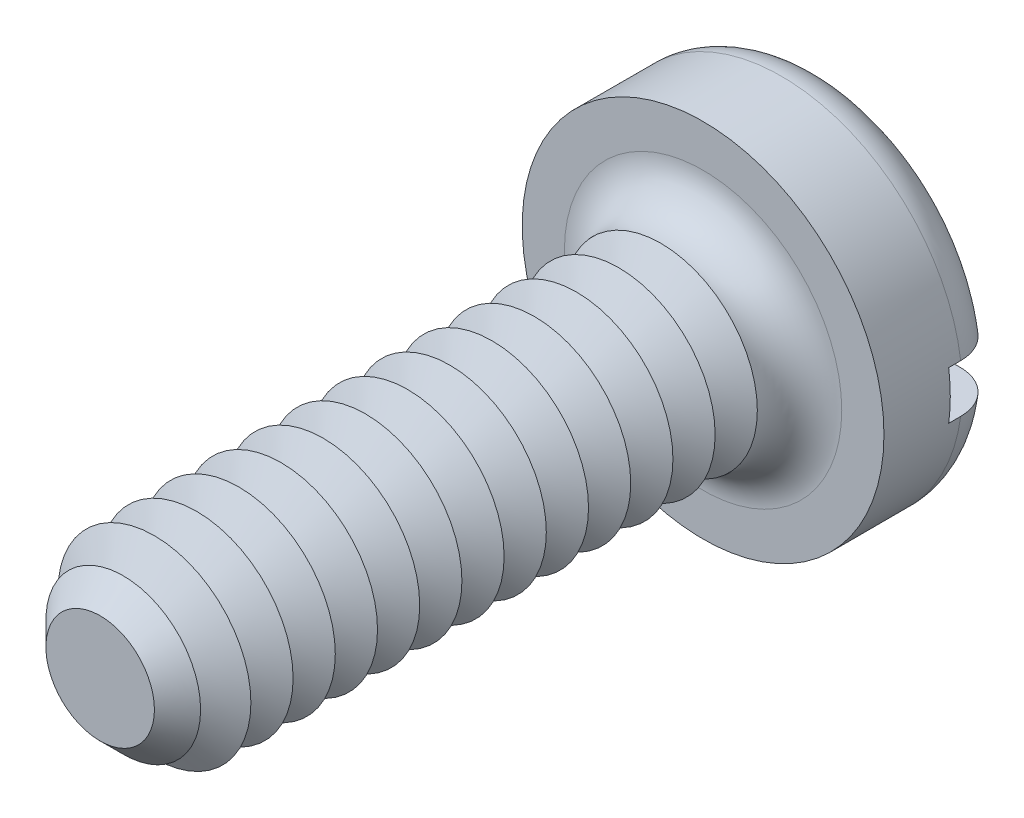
from build123d import *

# Parameters (mm, degrees)
SKETCH3_R           = 1.5
BOSS_EXTRUDE2_DEPTH = 1
SKETCH4_R           = 0.8
BOSS_EXTRUDE3_DEPTH = 5
FILLET1_R           = 0.35
CHAMFER1_SIZE       = 0.35
LPATTERN1_COUNT     = 13
LPATTERN1_PITCH     = 0.35
SKETCH8_W           = 3
SKETCH8_H           = 0.4
CUT_EXTRUDE1_DEPTH  = 0.45


with BuildPart() as part:
    # Sketch3 → Boss-Extrude2 (new body)
    with BuildSketch(Plane.XY):
        Circle(SKETCH3_R)
    extrude(amount=-BOSS_EXTRUDE2_DEPTH)

    # Sketch4 → Boss-Extrude3 (add)
    with BuildSketch(Plane.XY):
        Circle(SKETCH4_R)
    extrude(amount=BOSS_EXTRUDE3_DEPTH)

    # Fillet1
    fillet1_edges = [part.edges().sort_by_distance(p)[0] for p in [
        (-1.5, 0, -1),
        (-0.8, 0, 0),
    ]]
    fillet(fillet1_edges, radius=FILLET1_R)

    # Chamfer1
    chamfer1_edges = [part.edges().sort_by_distance(p)[0] for p in [
        (-0.8, 0, 5),
    ]]
    chamfer(chamfer1_edges, length=CHAMFER1_SIZE)

    # Sketch6 → Cut-Revolve1 (revolve, cut)
    with BuildSketch(Plane(origin=(0, 0, 0), x_dir=(0, 0, -1), z_dir=(1, 0, 0)), mode=Mode.PRIVATE) as cut_revolve1_sk:
        Polygon((-0.35, 0.8), (-0.525, 0.496891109), (-0.7, 0.8), align=None)
    cut_revolve1 = revolve(cut_revolve1_sk.sketch.rotate(Axis((0, 0, -1.694361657), (0, 0, 1)), 90), axis=Axis((0, 0, -1.694361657), (0, 0, 1)), mode=Mode.SUBTRACT)

    # LPattern1: Cut-Revolve1 ×13
    with Locations(*[(0, 0, i * LPATTERN1_PITCH) for i in range(1, LPATTERN1_COUNT)]):
        add(cut_revolve1, mode=Mode.SUBTRACT)

    # Sketch8 → Cut-Extrude1 (cut)
    with BuildSketch(Plane(origin=(0, 0, -1), x_dir=(-1, 0, 0), z_dir=(0, 0, -1))):
        Rectangle(SKETCH8_W, SKETCH8_H)
    extrude(amount=-CUT_EXTRUDE1_DEPTH, mode=Mode.SUBTRACT)


solid = part.part
